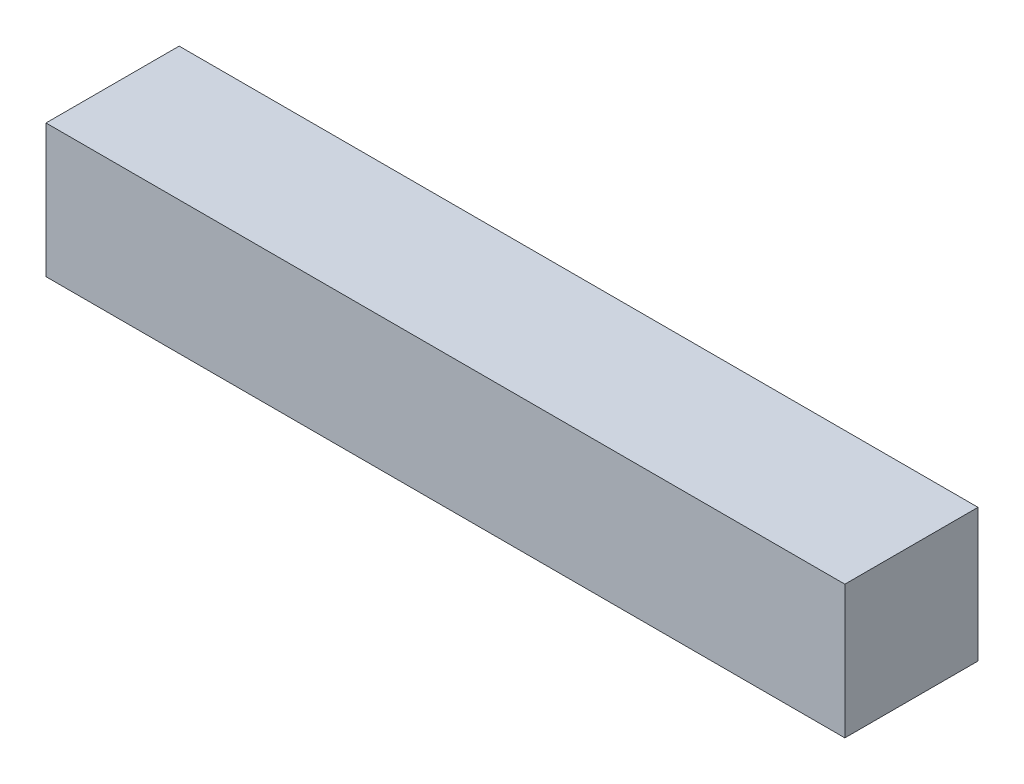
ISO-10303-21;
HEADER;
FILE_DESCRIPTION(('STEP AP214'),'2;1');
FILE_NAME('part.step','',(''),(''),'','','');
FILE_SCHEMA(('AUTOMOTIVE_DESIGN { 1 0 10303 214 1 1 1 1 }'));
ENDSEC;
DATA;
#1=APPLICATION_CONTEXT('core data for automotive mechanical design processes');
#2=APPLICATION_PROTOCOL_DEFINITION('international standard','automotive_design',2000,#1);
#3=PRODUCT_CONTEXT('',#1,'mechanical');
#4=PRODUCT('Part','Part','',(#3));
#5=PRODUCT_RELATED_PRODUCT_CATEGORY('part','',(#4));
#6=PRODUCT_DEFINITION_FORMATION('','',#4);
#7=PRODUCT_DEFINITION_CONTEXT('part definition',#1,'design');
#8=PRODUCT_DEFINITION('design','',#6,#7);
#9=PRODUCT_DEFINITION_SHAPE('','',#8);
#10=(LENGTH_UNIT() NAMED_UNIT(*) SI_UNIT(.MILLI.,.METRE.));
#11=(NAMED_UNIT(*) PLANE_ANGLE_UNIT() SI_UNIT($,.RADIAN.));
#12=(NAMED_UNIT(*) SI_UNIT($,.STERADIAN.) SOLID_ANGLE_UNIT());
#13=UNCERTAINTY_MEASURE_WITH_UNIT(LENGTH_MEASURE(1.E-05),#10,'distance_accuracy_value','');
#14=(GEOMETRIC_REPRESENTATION_CONTEXT(3) GLOBAL_UNCERTAINTY_ASSIGNED_CONTEXT((#13)) GLOBAL_UNIT_ASSIGNED_CONTEXT((#10,
#11,#12)) REPRESENTATION_CONTEXT('',''));
#15=CARTESIAN_POINT('',(0.,0.,0.));
#16=DIRECTION('',(0.,0.,1.));
#17=DIRECTION('',(1.,0.,0.));
#18=AXIS2_PLACEMENT_3D('',#15,#16,#17);
#19=CARTESIAN_POINT('',(0.,20.,0.));
#20=DIRECTION('',(1.,0.,0.));
#21=DIRECTION('',(0.,0.,-1.));
#22=AXIS2_PLACEMENT_3D('',#19,#20,#21);
#23=PLANE('',#22);
#24=DIRECTION('',(0.,0.,1.));
#25=VECTOR('',#24,1.);
#26=CARTESIAN_POINT('',(0.,0.,0.));
#27=LINE('',#26,#25);
#28=CARTESIAN_POINT('',(0.,0.,-20.));
#29=VERTEX_POINT('',#28);
#30=CARTESIAN_POINT('',(0.,0.,0.));
#31=VERTEX_POINT('',#30);
#32=EDGE_CURVE('E94',#29,#31,#27,.T.);
#33=ORIENTED_EDGE('',*,*,#32,.T.);
#34=DIRECTION('',(0.,-1.,0.));
#35=VECTOR('',#34,1.);
#36=CARTESIAN_POINT('',(0.,20.,0.));
#37=LINE('',#36,#35);
#38=CARTESIAN_POINT('',(0.,20.,0.));
#39=VERTEX_POINT('',#38);
#40=EDGE_CURVE('E11',#39,#31,#37,.T.);
#41=ORIENTED_EDGE('',*,*,#40,.F.);
#42=DIRECTION('',(0.,0.,1.));
#43=VECTOR('',#42,1.);
#44=CARTESIAN_POINT('',(0.,20.,0.));
#45=LINE('',#44,#43);
#46=CARTESIAN_POINT('',(0.,20.,-20.));
#47=VERTEX_POINT('',#46);
#48=EDGE_CURVE('E82',#47,#39,#45,.T.);
#49=ORIENTED_EDGE('',*,*,#48,.F.);
#50=DIRECTION('',(0.,-1.,0.));
#51=VECTOR('',#50,1.);
#52=CARTESIAN_POINT('',(0.,20.,-20.));
#53=LINE('',#52,#51);
#54=EDGE_CURVE('E90',#47,#29,#53,.T.);
#55=ORIENTED_EDGE('',*,*,#54,.T.);
#56=EDGE_LOOP('',(#33,#41,#49,#55));
#57=FACE_BOUND('',#56,.T.);
#58=ADVANCED_FACE('F31',(#57),#23,.F.);
#59=CARTESIAN_POINT('',(0.,20.,0.));
#60=DIRECTION('',(0.,0.,-1.));
#61=DIRECTION('',(-1.,0.,0.));
#62=AXIS2_PLACEMENT_3D('',#59,#60,#61);
#63=PLANE('',#62);
#64=DIRECTION('',(1.,0.,0.));
#65=VECTOR('',#64,1.);
#66=CARTESIAN_POINT('',(0.,0.,0.));
#67=LINE('',#66,#65);
#68=CARTESIAN_POINT('',(120.,0.,0.));
#69=VERTEX_POINT('',#68);
#70=EDGE_CURVE('E86',#31,#69,#67,.T.);
#71=ORIENTED_EDGE('',*,*,#70,.T.);
#72=DIRECTION('',(0.,-1.,0.));
#73=VECTOR('',#72,1.);
#74=CARTESIAN_POINT('',(120.,20.,0.));
#75=LINE('',#74,#73);
#76=CARTESIAN_POINT('',(120.,20.,0.));
#77=VERTEX_POINT('',#76);
#78=EDGE_CURVE('E39',#77,#69,#75,.T.);
#79=ORIENTED_EDGE('',*,*,#78,.F.);
#80=DIRECTION('',(1.,0.,0.));
#81=VECTOR('',#80,1.);
#82=CARTESIAN_POINT('',(0.,20.,0.));
#83=LINE('',#82,#81);
#84=EDGE_CURVE('E77',#39,#77,#83,.T.);
#85=ORIENTED_EDGE('',*,*,#84,.F.);
#86=ORIENTED_EDGE('',*,*,#40,.T.);
#87=EDGE_LOOP('',(#71,#79,#85,#86));
#88=FACE_BOUND('',#87,.T.);
#89=ADVANCED_FACE('F85',(#88),#63,.F.);
#90=CARTESIAN_POINT('',(120.,20.,0.));
#91=DIRECTION('',(-1.,0.,0.));
#92=DIRECTION('',(0.,0.,1.));
#93=AXIS2_PLACEMENT_3D('',#90,#91,#92);
#94=PLANE('',#93);
#95=DIRECTION('',(0.,0.,-1.));
#96=VECTOR('',#95,1.);
#97=CARTESIAN_POINT('',(120.,0.,0.));
#98=LINE('',#97,#96);
#99=CARTESIAN_POINT('',(120.,0.,-20.));
#100=VERTEX_POINT('',#99);
#101=EDGE_CURVE('E64',#69,#100,#98,.T.);
#102=ORIENTED_EDGE('',*,*,#101,.T.);
#103=DIRECTION('',(0.,-1.,0.));
#104=VECTOR('',#103,1.);
#105=CARTESIAN_POINT('',(120.,20.,-20.));
#106=LINE('',#105,#104);
#107=CARTESIAN_POINT('',(120.,20.,-20.));
#108=VERTEX_POINT('',#107);
#109=EDGE_CURVE('E87',#108,#100,#106,.T.);
#110=ORIENTED_EDGE('',*,*,#109,.F.);
#111=DIRECTION('',(0.,0.,-1.));
#112=VECTOR('',#111,1.);
#113=CARTESIAN_POINT('',(120.,20.,0.));
#114=LINE('',#113,#112);
#115=EDGE_CURVE('E80',#77,#108,#114,.T.);
#116=ORIENTED_EDGE('',*,*,#115,.F.);
#117=ORIENTED_EDGE('',*,*,#78,.T.);
#118=EDGE_LOOP('',(#102,#110,#116,#117));
#119=FACE_BOUND('',#118,.T.);
#120=ADVANCED_FACE('F88',(#119),#94,.F.);
#121=CARTESIAN_POINT('',(0.,20.,-20.));
#122=DIRECTION('',(0.,0.,1.));
#123=DIRECTION('',(1.,0.,0.));
#124=AXIS2_PLACEMENT_3D('',#121,#122,#123);
#125=PLANE('',#124);
#126=DIRECTION('',(-1.,0.,0.));
#127=VECTOR('',#126,1.);
#128=CARTESIAN_POINT('',(0.,0.,-20.));
#129=LINE('',#128,#127);
#130=EDGE_CURVE('E70',#100,#29,#129,.T.);
#131=ORIENTED_EDGE('',*,*,#130,.T.);
#132=ORIENTED_EDGE('',*,*,#54,.F.);
#133=DIRECTION('',(-1.,0.,0.));
#134=VECTOR('',#133,1.);
#135=CARTESIAN_POINT('',(0.,20.,-20.));
#136=LINE('',#135,#134);
#137=EDGE_CURVE('E47',#108,#47,#136,.T.);
#138=ORIENTED_EDGE('',*,*,#137,.F.);
#139=ORIENTED_EDGE('',*,*,#109,.T.);
#140=EDGE_LOOP('',(#131,#132,#138,#139));
#141=FACE_BOUND('',#140,.T.);
#142=ADVANCED_FACE('F101',(#141),#125,.F.);
#143=CARTESIAN_POINT('',(0.,20.,-20.));
#144=DIRECTION('',(0.,-1.,0.));
#145=DIRECTION('',(0.,0.,-1.));
#146=AXIS2_PLACEMENT_3D('',#143,#144,#145);
#147=PLANE('',#146);
#148=ORIENTED_EDGE('',*,*,#48,.T.);
#149=ORIENTED_EDGE('',*,*,#84,.T.);
#150=ORIENTED_EDGE('',*,*,#115,.T.);
#151=ORIENTED_EDGE('',*,*,#137,.T.);
#152=EDGE_LOOP('',(#148,#149,#150,#151));
#153=FACE_BOUND('',#152,.T.);
#154=ADVANCED_FACE('F78',(#153),#147,.F.);
#155=CARTESIAN_POINT('',(0.,0.,-20.));
#156=DIRECTION('',(0.,-1.,0.));
#157=DIRECTION('',(0.,0.,-1.));
#158=AXIS2_PLACEMENT_3D('',#155,#156,#157);
#159=PLANE('',#158);
#160=ORIENTED_EDGE('',*,*,#32,.F.);
#161=ORIENTED_EDGE('',*,*,#130,.F.);
#162=ORIENTED_EDGE('',*,*,#101,.F.);
#163=ORIENTED_EDGE('',*,*,#70,.F.);
#164=EDGE_LOOP('',(#160,#161,#162,#163));
#165=FACE_BOUND('',#164,.T.);
#166=ADVANCED_FACE('F104',(#165),#159,.T.);
#167=CLOSED_SHELL('',(#58,#89,#120,#142,#154,#166));
#168=MANIFOLD_SOLID_BREP('B2',#167);
#169=ADVANCED_BREP_SHAPE_REPRESENTATION('',(#18,#168),#14);
#170=SHAPE_DEFINITION_REPRESENTATION(#9,#169);
ENDSEC;
END-ISO-10303-21;
